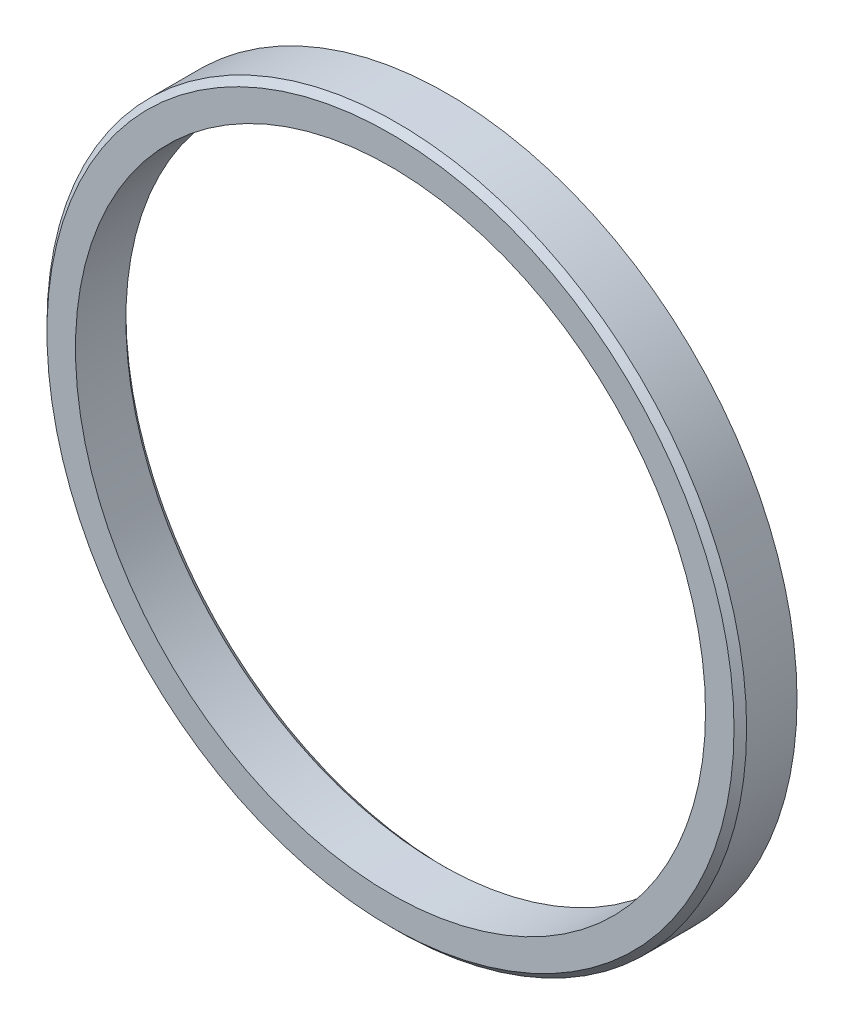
ISO-10303-21;
HEADER;
FILE_DESCRIPTION(('STEP AP214'),'2;1');
FILE_NAME('part.step','',(''),(''),'','','');
FILE_SCHEMA(('AUTOMOTIVE_DESIGN { 1 0 10303 214 1 1 1 1 }'));
ENDSEC;
DATA;
#1=APPLICATION_CONTEXT('core data for automotive mechanical design processes');
#2=APPLICATION_PROTOCOL_DEFINITION('international standard','automotive_design',2000,#1);
#3=PRODUCT_CONTEXT('',#1,'mechanical');
#4=PRODUCT('Part','Part','',(#3));
#5=PRODUCT_RELATED_PRODUCT_CATEGORY('part','',(#4));
#6=PRODUCT_DEFINITION_FORMATION('','',#4);
#7=PRODUCT_DEFINITION_CONTEXT('part definition',#1,'design');
#8=PRODUCT_DEFINITION('design','',#6,#7);
#9=PRODUCT_DEFINITION_SHAPE('','',#8);
#10=(LENGTH_UNIT() NAMED_UNIT(*) SI_UNIT(.MILLI.,.METRE.));
#11=(NAMED_UNIT(*) PLANE_ANGLE_UNIT() SI_UNIT($,.RADIAN.));
#12=(NAMED_UNIT(*) SI_UNIT($,.STERADIAN.) SOLID_ANGLE_UNIT());
#13=UNCERTAINTY_MEASURE_WITH_UNIT(LENGTH_MEASURE(1.E-05),#10,'distance_accuracy_value','');
#14=(GEOMETRIC_REPRESENTATION_CONTEXT(3) GLOBAL_UNCERTAINTY_ASSIGNED_CONTEXT((#13)) GLOBAL_UNIT_ASSIGNED_CONTEXT((#10,
#11,#12)) REPRESENTATION_CONTEXT('',''));
#15=CARTESIAN_POINT('',(0.,0.,0.));
#16=DIRECTION('',(0.,0.,1.));
#17=DIRECTION('',(1.,0.,0.));
#18=AXIS2_PLACEMENT_3D('',#15,#16,#17);
#19=CARTESIAN_POINT('',(0.,109.05,8.00000000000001));
#20=DIRECTION('',(0.,0.,-1.));
#21=DIRECTION('',(-1.,0.,0.));
#22=AXIS2_PLACEMENT_3D('',#19,#20,#21);
#23=PLANE('',#22);
#24=CARTESIAN_POINT('',(0.,0.,8.00000000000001));
#25=DIRECTION('',(0.,0.,1.));
#26=DIRECTION('',(1.,0.,0.));
#27=AXIS2_PLACEMENT_3D('',#24,#25,#26);
#28=CIRCLE('',#27,100.);
#29=CARTESIAN_POINT('',(100.,0.,8.00000000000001));
#30=VERTEX_POINT('',#29);
#31=EDGE_CURVE('E10',#30,#30,#28,.T.);
#32=ORIENTED_EDGE('',*,*,#31,.F.);
#33=EDGE_LOOP('',(#32));
#34=FACE_BOUND('',#33,.T.);
#35=CARTESIAN_POINT('',(0.,0.,8.00000000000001));
#36=DIRECTION('',(0.,0.,1.));
#37=DIRECTION('',(1.,0.,0.));
#38=AXIS2_PLACEMENT_3D('',#35,#36,#37);
#39=CIRCLE('',#38,109.05);
#40=CARTESIAN_POINT('',(109.05,0.,8.00000000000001));
#41=VERTEX_POINT('',#40);
#42=EDGE_CURVE('E55',#41,#41,#39,.T.);
#43=ORIENTED_EDGE('',*,*,#42,.T.);
#44=EDGE_LOOP('',(#43));
#45=FACE_BOUND('',#44,.T.);
#46=ADVANCED_FACE('F33',(#34,#45),#23,.F.);
#47=CARTESIAN_POINT('',(0.,0.,66.6227492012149));
#48=DIRECTION('',(0.,0.,1.));
#49=DIRECTION('',(1.,0.,0.));
#50=AXIS2_PLACEMENT_3D('',#47,#48,#49);
#51=CYLINDRICAL_SURFACE('',#50,100.);
#52=CARTESIAN_POINT('',(0.,0.,-8.00000000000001));
#53=DIRECTION('',(0.,0.,1.));
#54=DIRECTION('',(1.,0.,0.));
#55=AXIS2_PLACEMENT_3D('',#52,#53,#54);
#56=CIRCLE('',#55,100.);
#57=CARTESIAN_POINT('',(100.,0.,-8.00000000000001));
#58=VERTEX_POINT('',#57);
#59=EDGE_CURVE('E39',#58,#58,#56,.T.);
#60=ORIENTED_EDGE('',*,*,#59,.F.);
#61=EDGE_LOOP('',(#60));
#62=FACE_BOUND('',#61,.T.);
#63=ORIENTED_EDGE('',*,*,#31,.T.);
#64=EDGE_LOOP('',(#63));
#65=FACE_BOUND('',#64,.T.);
#66=ADVANCED_FACE('F80',(#62,#65),#51,.F.);
#67=CARTESIAN_POINT('',(0.,0.,-8.00000000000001));
#68=DIRECTION('',(0.,0.,-1.));
#69=DIRECTION('',(-1.,0.,0.));
#70=AXIS2_PLACEMENT_3D('',#67,#68,#69);
#71=CONICAL_SURFACE('',#70,100.,0.785398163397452);
#72=CARTESIAN_POINT('',(0.,0.,-9.99999999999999));
#73=DIRECTION('',(0.,0.,1.));
#74=DIRECTION('',(1.,0.,0.));
#75=AXIS2_PLACEMENT_3D('',#72,#73,#74);
#76=CIRCLE('',#75,102.);
#77=CARTESIAN_POINT('',(102.,0.,-9.99999999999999));
#78=VERTEX_POINT('',#77);
#79=EDGE_CURVE('E43',#78,#78,#76,.T.);
#80=ORIENTED_EDGE('',*,*,#79,.F.);
#81=EDGE_LOOP('',(#80));
#82=FACE_BOUND('',#81,.T.);
#83=ORIENTED_EDGE('',*,*,#59,.T.);
#84=EDGE_LOOP('',(#83));
#85=FACE_BOUND('',#84,.T.);
#86=ADVANCED_FACE('F75',(#82,#85),#71,.F.);
#87=CARTESIAN_POINT('',(0.,102.,-9.99999999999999));
#88=DIRECTION('',(0.,0.,1.));
#89=DIRECTION('',(1.,0.,0.));
#90=AXIS2_PLACEMENT_3D('',#87,#88,#89);
#91=PLANE('',#90);
#92=CARTESIAN_POINT('',(0.,0.,-9.99999999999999));
#93=DIRECTION('',(0.,0.,1.));
#94=DIRECTION('',(1.,0.,0.));
#95=AXIS2_PLACEMENT_3D('',#92,#93,#94);
#96=CIRCLE('',#95,111.05);
#97=CARTESIAN_POINT('',(111.05,0.,-9.99999999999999));
#98=VERTEX_POINT('',#97);
#99=EDGE_CURVE('E47',#98,#98,#96,.T.);
#100=ORIENTED_EDGE('',*,*,#99,.F.);
#101=EDGE_LOOP('',(#100));
#102=FACE_BOUND('',#101,.T.);
#103=ORIENTED_EDGE('',*,*,#79,.T.);
#104=EDGE_LOOP('',(#103));
#105=FACE_BOUND('',#104,.T.);
#106=ADVANCED_FACE('F69',(#102,#105),#91,.F.);
#107=CARTESIAN_POINT('',(0.,0.,66.6227492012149));
#108=DIRECTION('',(0.,0.,1.));
#109=DIRECTION('',(1.,0.,0.));
#110=AXIS2_PLACEMENT_3D('',#107,#108,#109);
#111=CYLINDRICAL_SURFACE('',#110,111.05);
#112=CARTESIAN_POINT('',(0.,0.,6.00000000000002));
#113=DIRECTION('',(0.,0.,1.));
#114=DIRECTION('',(1.,0.,0.));
#115=AXIS2_PLACEMENT_3D('',#112,#113,#114);
#116=CIRCLE('',#115,111.05);
#117=CARTESIAN_POINT('',(111.05,0.,6.00000000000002));
#118=VERTEX_POINT('',#117);
#119=EDGE_CURVE('E52',#118,#118,#116,.T.);
#120=ORIENTED_EDGE('',*,*,#119,.F.);
#121=EDGE_LOOP('',(#120));
#122=FACE_BOUND('',#121,.T.);
#123=ORIENTED_EDGE('',*,*,#99,.T.);
#124=EDGE_LOOP('',(#123));
#125=FACE_BOUND('',#124,.T.);
#126=ADVANCED_FACE('F63',(#122,#125),#111,.T.);
#127=CARTESIAN_POINT('',(0.,0.,6.00000000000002));
#128=DIRECTION('',(0.,0.,-1.));
#129=DIRECTION('',(-1.,0.,0.));
#130=AXIS2_PLACEMENT_3D('',#127,#128,#129);
#131=CONICAL_SURFACE('',#130,111.05,0.785398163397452);
#132=ORIENTED_EDGE('',*,*,#42,.F.);
#133=EDGE_LOOP('',(#132));
#134=FACE_BOUND('',#133,.T.);
#135=ORIENTED_EDGE('',*,*,#119,.T.);
#136=EDGE_LOOP('',(#135));
#137=FACE_BOUND('',#136,.T.);
#138=ADVANCED_FACE('F60',(#134,#137),#131,.T.);
#139=CLOSED_SHELL('',(#46,#66,#86,#106,#126,#138));
#140=MANIFOLD_SOLID_BREP('B2',#139);
#141=ADVANCED_BREP_SHAPE_REPRESENTATION('',(#18,#140),#14);
#142=SHAPE_DEFINITION_REPRESENTATION(#9,#141);
ENDSEC;
END-ISO-10303-21;
